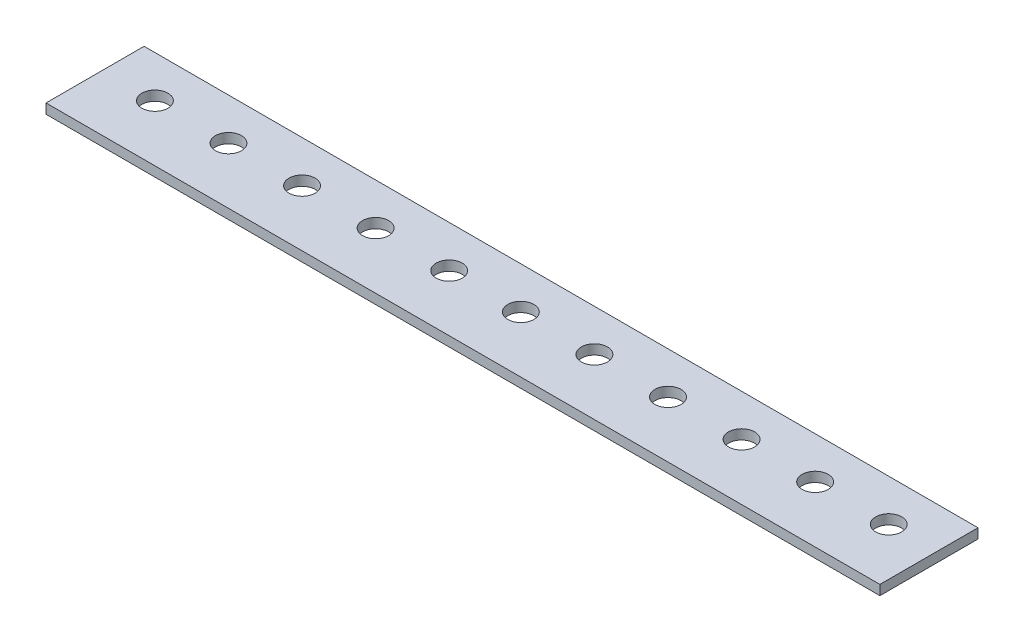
ISO-10303-21;
HEADER;
FILE_DESCRIPTION(('STEP AP214'),'2;1');
FILE_NAME('part.step','',(''),(''),'','','');
FILE_SCHEMA(('AUTOMOTIVE_DESIGN { 1 0 10303 214 1 1 1 1 }'));
ENDSEC;
DATA;
#1=APPLICATION_CONTEXT('core data for automotive mechanical design processes');
#2=APPLICATION_PROTOCOL_DEFINITION('international standard','automotive_design',2000,#1);
#3=PRODUCT_CONTEXT('',#1,'mechanical');
#4=PRODUCT('Part','Part','',(#3));
#5=PRODUCT_RELATED_PRODUCT_CATEGORY('part','',(#4));
#6=PRODUCT_DEFINITION_FORMATION('','',#4);
#7=PRODUCT_DEFINITION_CONTEXT('part definition',#1,'design');
#8=PRODUCT_DEFINITION('design','',#6,#7);
#9=PRODUCT_DEFINITION_SHAPE('','',#8);
#10=(LENGTH_UNIT() NAMED_UNIT(*) SI_UNIT(.MILLI.,.METRE.));
#11=(NAMED_UNIT(*) PLANE_ANGLE_UNIT() SI_UNIT($,.RADIAN.));
#12=(NAMED_UNIT(*) SI_UNIT($,.STERADIAN.) SOLID_ANGLE_UNIT());
#13=UNCERTAINTY_MEASURE_WITH_UNIT(LENGTH_MEASURE(1.E-05),#10,'distance_accuracy_value','');
#14=(GEOMETRIC_REPRESENTATION_CONTEXT(3) GLOBAL_UNCERTAINTY_ASSIGNED_CONTEXT((#13)) GLOBAL_UNIT_ASSIGNED_CONTEXT((#10,
#11,#12)) REPRESENTATION_CONTEXT('',''));
#15=CARTESIAN_POINT('',(0.,0.,0.));
#16=DIRECTION('',(0.,0.,1.));
#17=DIRECTION('',(1.,0.,0.));
#18=AXIS2_PLACEMENT_3D('',#15,#16,#17);
#19=CARTESIAN_POINT('',(0.,2.54,123.825));
#20=DIRECTION('',(0.,0.,1.));
#21=DIRECTION('',(1.,0.,0.));
#22=AXIS2_PLACEMENT_3D('',#19,#20,#21);
#23=PLANE('',#22);
#24=DIRECTION('',(0.,1.,0.));
#25=VECTOR('',#24,1.);
#26=CARTESIAN_POINT('',(-469.842285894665,0.,123.825));
#27=LINE('',#26,#25);
#28=CARTESIAN_POINT('',(-469.842285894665,0.,123.825));
#29=VERTEX_POINT('',#28);
#30=CARTESIAN_POINT('',(-469.842285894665,2.54,123.825));
#31=VERTEX_POINT('',#30);
#32=EDGE_CURVE('E77',#29,#31,#27,.T.);
#33=ORIENTED_EDGE('',*,*,#32,.T.);
#34=DIRECTION('',(-1.,0.,0.));
#35=VECTOR('',#34,1.);
#36=CARTESIAN_POINT('',(0.,2.54,123.825));
#37=LINE('',#36,#35);
#38=CARTESIAN_POINT('',(-253.942285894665,2.54,123.825));
#39=VERTEX_POINT('',#38);
#40=EDGE_CURVE('E43',#39,#31,#37,.T.);
#41=ORIENTED_EDGE('',*,*,#40,.F.);
#42=DIRECTION('',(0.,-1.,0.));
#43=VECTOR('',#42,1.);
#44=CARTESIAN_POINT('',(-253.942285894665,2.54,123.825));
#45=LINE('',#44,#43);
#46=CARTESIAN_POINT('',(-253.942285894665,0.,123.825));
#47=VERTEX_POINT('',#46);
#48=EDGE_CURVE('E11',#39,#47,#45,.T.);
#49=ORIENTED_EDGE('',*,*,#48,.T.);
#50=DIRECTION('',(-1.,0.,0.));
#51=VECTOR('',#50,1.);
#52=CARTESIAN_POINT('',(0.,0.,123.825));
#53=LINE('',#52,#51);
#54=EDGE_CURVE('E93',#47,#29,#53,.T.);
#55=ORIENTED_EDGE('',*,*,#54,.T.);
#56=EDGE_LOOP('',(#33,#41,#49,#55));
#57=FACE_BOUND('',#56,.T.);
#58=ADVANCED_FACE('F35',(#57),#23,.F.);
#59=CARTESIAN_POINT('',(0.,2.54,0.));
#60=DIRECTION('',(0.,1.,0.));
#61=DIRECTION('',(0.,0.,1.));
#62=AXIS2_PLACEMENT_3D('',#59,#60,#61);
#63=PLANE('',#62);
#64=CARTESIAN_POINT('',(-361.511285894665,2.54,134.62));
#65=DIRECTION('',(0.,1.,0.));
#66=DIRECTION('',(0.,0.,1.));
#67=AXIS2_PLACEMENT_3D('',#64,#65,#66);
#68=CIRCLE('',#67,3.37819999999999);
#69=CARTESIAN_POINT('',(-361.511285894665,2.54,137.9982));
#70=VERTEX_POINT('',#69);
#71=EDGE_CURVE('E139',#70,#70,#68,.T.);
#72=ORIENTED_EDGE('',*,*,#71,.F.);
#73=EDGE_LOOP('',(#72));
#74=FACE_BOUND('',#73,.T.);
#75=CARTESIAN_POINT('',(-456.253285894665,2.54,134.62));
#76=DIRECTION('',(0.,1.,0.));
#77=DIRECTION('',(0.,0.,1.));
#78=AXIS2_PLACEMENT_3D('',#75,#76,#77);
#79=CIRCLE('',#78,3.37819999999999);
#80=CARTESIAN_POINT('',(-456.253285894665,2.54,137.9982));
#81=VERTEX_POINT('',#80);
#82=EDGE_CURVE('E142',#81,#81,#79,.T.);
#83=ORIENTED_EDGE('',*,*,#82,.F.);
#84=EDGE_LOOP('',(#83));
#85=FACE_BOUND('',#84,.T.);
#86=CARTESIAN_POINT('',(-437.203285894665,2.54,134.62));
#87=DIRECTION('',(0.,1.,0.));
#88=DIRECTION('',(0.,0.,1.));
#89=AXIS2_PLACEMENT_3D('',#86,#87,#88);
#90=CIRCLE('',#89,3.37819999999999);
#91=CARTESIAN_POINT('',(-437.203285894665,2.54,137.9982));
#92=VERTEX_POINT('',#91);
#93=EDGE_CURVE('E145',#92,#92,#90,.T.);
#94=ORIENTED_EDGE('',*,*,#93,.F.);
#95=EDGE_LOOP('',(#94));
#96=FACE_BOUND('',#95,.T.);
#97=CARTESIAN_POINT('',(-418.153285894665,2.54,134.62));
#98=DIRECTION('',(0.,1.,0.));
#99=DIRECTION('',(0.,0.,1.));
#100=AXIS2_PLACEMENT_3D('',#97,#98,#99);
#101=CIRCLE('',#100,3.37819999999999);
#102=CARTESIAN_POINT('',(-418.153285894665,2.54,137.9982));
#103=VERTEX_POINT('',#102);
#104=EDGE_CURVE('E148',#103,#103,#101,.T.);
#105=ORIENTED_EDGE('',*,*,#104,.F.);
#106=EDGE_LOOP('',(#105));
#107=FACE_BOUND('',#106,.T.);
#108=CARTESIAN_POINT('',(-399.103285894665,2.54,134.62));
#109=DIRECTION('',(0.,1.,0.));
#110=DIRECTION('',(0.,0.,1.));
#111=AXIS2_PLACEMENT_3D('',#108,#109,#110);
#112=CIRCLE('',#111,3.37819999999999);
#113=CARTESIAN_POINT('',(-399.103285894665,2.54,137.9982));
#114=VERTEX_POINT('',#113);
#115=EDGE_CURVE('E151',#114,#114,#112,.T.);
#116=ORIENTED_EDGE('',*,*,#115,.F.);
#117=EDGE_LOOP('',(#116));
#118=FACE_BOUND('',#117,.T.);
#119=CARTESIAN_POINT('',(-380.053285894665,2.54,134.62));
#120=DIRECTION('',(0.,1.,0.));
#121=DIRECTION('',(0.,0.,1.));
#122=AXIS2_PLACEMENT_3D('',#119,#120,#121);
#123=CIRCLE('',#122,3.37819999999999);
#124=CARTESIAN_POINT('',(-380.053285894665,2.54,137.9982));
#125=VERTEX_POINT('',#124);
#126=EDGE_CURVE('E154',#125,#125,#123,.T.);
#127=ORIENTED_EDGE('',*,*,#126,.F.);
#128=EDGE_LOOP('',(#127));
#129=FACE_BOUND('',#128,.T.);
#130=CARTESIAN_POINT('',(-342.461285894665,2.54,134.62));
#131=DIRECTION('',(0.,1.,0.));
#132=DIRECTION('',(0.,0.,1.));
#133=AXIS2_PLACEMENT_3D('',#130,#131,#132);
#134=CIRCLE('',#133,3.37819999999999);
#135=CARTESIAN_POINT('',(-342.461285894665,2.54,137.9982));
#136=VERTEX_POINT('',#135);
#137=EDGE_CURVE('E157',#136,#136,#134,.T.);
#138=ORIENTED_EDGE('',*,*,#137,.F.);
#139=EDGE_LOOP('',(#138));
#140=FACE_BOUND('',#139,.T.);
#141=CARTESIAN_POINT('',(-323.411285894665,2.54,134.62));
#142=DIRECTION('',(0.,1.,0.));
#143=DIRECTION('',(0.,0.,1.));
#144=AXIS2_PLACEMENT_3D('',#141,#142,#143);
#145=CIRCLE('',#144,3.37819999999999);
#146=CARTESIAN_POINT('',(-323.411285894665,2.54,137.9982));
#147=VERTEX_POINT('',#146);
#148=EDGE_CURVE('E160',#147,#147,#145,.T.);
#149=ORIENTED_EDGE('',*,*,#148,.F.);
#150=EDGE_LOOP('',(#149));
#151=FACE_BOUND('',#150,.T.);
#152=CARTESIAN_POINT('',(-304.361285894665,2.54,134.62));
#153=DIRECTION('',(0.,1.,0.));
#154=DIRECTION('',(0.,0.,1.));
#155=AXIS2_PLACEMENT_3D('',#152,#153,#154);
#156=CIRCLE('',#155,3.37819999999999);
#157=CARTESIAN_POINT('',(-304.361285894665,2.54,137.9982));
#158=VERTEX_POINT('',#157);
#159=EDGE_CURVE('E163',#158,#158,#156,.T.);
#160=ORIENTED_EDGE('',*,*,#159,.F.);
#161=EDGE_LOOP('',(#160));
#162=FACE_BOUND('',#161,.T.);
#163=CARTESIAN_POINT('',(-285.311285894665,2.54,134.62));
#164=DIRECTION('',(0.,1.,0.));
#165=DIRECTION('',(0.,0.,1.));
#166=AXIS2_PLACEMENT_3D('',#163,#164,#165);
#167=CIRCLE('',#166,3.37819999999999);
#168=CARTESIAN_POINT('',(-285.311285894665,2.54,137.9982));
#169=VERTEX_POINT('',#168);
#170=EDGE_CURVE('E100',#169,#169,#167,.T.);
#171=ORIENTED_EDGE('',*,*,#170,.F.);
#172=EDGE_LOOP('',(#171));
#173=FACE_BOUND('',#172,.T.);
#174=CARTESIAN_POINT('',(-266.261285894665,2.54,134.62));
#175=DIRECTION('',(0.,1.,0.));
#176=DIRECTION('',(0.,0.,1.));
#177=AXIS2_PLACEMENT_3D('',#174,#175,#176);
#178=CIRCLE('',#177,3.37819999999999);
#179=CARTESIAN_POINT('',(-266.261285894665,2.54,137.9982));
#180=VERTEX_POINT('',#179);
#181=EDGE_CURVE('E97',#180,#180,#178,.T.);
#182=ORIENTED_EDGE('',*,*,#181,.F.);
#183=EDGE_LOOP('',(#182));
#184=FACE_BOUND('',#183,.T.);
#185=ORIENTED_EDGE('',*,*,#40,.T.);
#186=DIRECTION('',(0.,0.,1.));
#187=VECTOR('',#186,1.);
#188=CARTESIAN_POINT('',(-469.842285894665,2.54,0.));
#189=LINE('',#188,#187);
#190=CARTESIAN_POINT('',(-469.842285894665,2.54,149.225));
#191=VERTEX_POINT('',#190);
#192=EDGE_CURVE('E83',#31,#191,#189,.T.);
#193=ORIENTED_EDGE('',*,*,#192,.T.);
#194=DIRECTION('',(-1.,0.,0.));
#195=VECTOR('',#194,1.);
#196=CARTESIAN_POINT('',(0.,2.54,149.225));
#197=LINE('',#196,#195);
#198=CARTESIAN_POINT('',(-253.942285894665,2.54,149.225));
#199=VERTEX_POINT('',#198);
#200=EDGE_CURVE('E94',#199,#191,#197,.T.);
#201=ORIENTED_EDGE('',*,*,#200,.F.);
#202=DIRECTION('',(0.,0.,-1.));
#203=VECTOR('',#202,1.);
#204=CARTESIAN_POINT('',(-253.942285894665,2.54,3.69990252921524E-13));
#205=LINE('',#204,#203);
#206=EDGE_CURVE('E59',#199,#39,#205,.T.);
#207=ORIENTED_EDGE('',*,*,#206,.T.);
#208=EDGE_LOOP('',(#185,#193,#201,#207));
#209=FACE_BOUND('',#208,.T.);
#210=ADVANCED_FACE('F172',(#74,#85,#96,#107,#118,#129,#140,#151,#162,#173,#184,#209),#63,.T.);
#211=CARTESIAN_POINT('',(0.,0.,0.));
#212=DIRECTION('',(0.,1.,0.));
#213=DIRECTION('',(0.,0.,1.));
#214=AXIS2_PLACEMENT_3D('',#211,#212,#213);
#215=PLANE('',#214);
#216=CARTESIAN_POINT('',(-361.511285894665,0.,134.62));
#217=DIRECTION('',(0.,1.,0.));
#218=DIRECTION('',(0.,0.,1.));
#219=AXIS2_PLACEMENT_3D('',#216,#217,#218);
#220=CIRCLE('',#219,3.37819999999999);
#221=CARTESIAN_POINT('',(-361.511285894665,0.,137.9982));
#222=VERTEX_POINT('',#221);
#223=EDGE_CURVE('E102',#222,#222,#220,.T.);
#224=ORIENTED_EDGE('',*,*,#223,.T.);
#225=EDGE_LOOP('',(#224));
#226=FACE_BOUND('',#225,.T.);
#227=CARTESIAN_POINT('',(-456.253285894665,0.,134.62));
#228=DIRECTION('',(0.,1.,0.));
#229=DIRECTION('',(0.,0.,1.));
#230=AXIS2_PLACEMENT_3D('',#227,#228,#229);
#231=CIRCLE('',#230,3.37819999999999);
#232=CARTESIAN_POINT('',(-456.253285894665,0.,137.9982));
#233=VERTEX_POINT('',#232);
#234=EDGE_CURVE('E107',#233,#233,#231,.T.);
#235=ORIENTED_EDGE('',*,*,#234,.T.);
#236=EDGE_LOOP('',(#235));
#237=FACE_BOUND('',#236,.T.);
#238=CARTESIAN_POINT('',(-437.203285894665,0.,134.62));
#239=DIRECTION('',(0.,1.,0.));
#240=DIRECTION('',(0.,0.,1.));
#241=AXIS2_PLACEMENT_3D('',#238,#239,#240);
#242=CIRCLE('',#241,3.37819999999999);
#243=CARTESIAN_POINT('',(-437.203285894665,0.,137.9982));
#244=VERTEX_POINT('',#243);
#245=EDGE_CURVE('E110',#244,#244,#242,.T.);
#246=ORIENTED_EDGE('',*,*,#245,.T.);
#247=EDGE_LOOP('',(#246));
#248=FACE_BOUND('',#247,.T.);
#249=CARTESIAN_POINT('',(-418.153285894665,0.,134.62));
#250=DIRECTION('',(0.,1.,0.));
#251=DIRECTION('',(0.,0.,1.));
#252=AXIS2_PLACEMENT_3D('',#249,#250,#251);
#253=CIRCLE('',#252,3.37819999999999);
#254=CARTESIAN_POINT('',(-418.153285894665,0.,137.9982));
#255=VERTEX_POINT('',#254);
#256=EDGE_CURVE('E113',#255,#255,#253,.T.);
#257=ORIENTED_EDGE('',*,*,#256,.T.);
#258=EDGE_LOOP('',(#257));
#259=FACE_BOUND('',#258,.T.);
#260=CARTESIAN_POINT('',(-399.103285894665,0.,134.62));
#261=DIRECTION('',(0.,1.,0.));
#262=DIRECTION('',(0.,0.,1.));
#263=AXIS2_PLACEMENT_3D('',#260,#261,#262);
#264=CIRCLE('',#263,3.37819999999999);
#265=CARTESIAN_POINT('',(-399.103285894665,0.,137.9982));
#266=VERTEX_POINT('',#265);
#267=EDGE_CURVE('E116',#266,#266,#264,.T.);
#268=ORIENTED_EDGE('',*,*,#267,.T.);
#269=EDGE_LOOP('',(#268));
#270=FACE_BOUND('',#269,.T.);
#271=CARTESIAN_POINT('',(-380.053285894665,0.,134.62));
#272=DIRECTION('',(0.,1.,0.));
#273=DIRECTION('',(0.,0.,1.));
#274=AXIS2_PLACEMENT_3D('',#271,#272,#273);
#275=CIRCLE('',#274,3.37819999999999);
#276=CARTESIAN_POINT('',(-380.053285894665,0.,137.9982));
#277=VERTEX_POINT('',#276);
#278=EDGE_CURVE('E119',#277,#277,#275,.T.);
#279=ORIENTED_EDGE('',*,*,#278,.T.);
#280=EDGE_LOOP('',(#279));
#281=FACE_BOUND('',#280,.T.);
#282=CARTESIAN_POINT('',(-342.461285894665,0.,134.62));
#283=DIRECTION('',(0.,1.,0.));
#284=DIRECTION('',(0.,0.,1.));
#285=AXIS2_PLACEMENT_3D('',#282,#283,#284);
#286=CIRCLE('',#285,3.37819999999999);
#287=CARTESIAN_POINT('',(-342.461285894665,0.,137.9982));
#288=VERTEX_POINT('',#287);
#289=EDGE_CURVE('E122',#288,#288,#286,.T.);
#290=ORIENTED_EDGE('',*,*,#289,.T.);
#291=EDGE_LOOP('',(#290));
#292=FACE_BOUND('',#291,.T.);
#293=CARTESIAN_POINT('',(-323.411285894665,0.,134.62));
#294=DIRECTION('',(0.,1.,0.));
#295=DIRECTION('',(0.,0.,1.));
#296=AXIS2_PLACEMENT_3D('',#293,#294,#295);
#297=CIRCLE('',#296,3.37819999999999);
#298=CARTESIAN_POINT('',(-323.411285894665,0.,137.9982));
#299=VERTEX_POINT('',#298);
#300=EDGE_CURVE('E125',#299,#299,#297,.T.);
#301=ORIENTED_EDGE('',*,*,#300,.T.);
#302=EDGE_LOOP('',(#301));
#303=FACE_BOUND('',#302,.T.);
#304=CARTESIAN_POINT('',(-304.361285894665,0.,134.62));
#305=DIRECTION('',(0.,1.,0.));
#306=DIRECTION('',(0.,0.,1.));
#307=AXIS2_PLACEMENT_3D('',#304,#305,#306);
#308=CIRCLE('',#307,3.37819999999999);
#309=CARTESIAN_POINT('',(-304.361285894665,0.,137.9982));
#310=VERTEX_POINT('',#309);
#311=EDGE_CURVE('E128',#310,#310,#308,.T.);
#312=ORIENTED_EDGE('',*,*,#311,.T.);
#313=EDGE_LOOP('',(#312));
#314=FACE_BOUND('',#313,.T.);
#315=CARTESIAN_POINT('',(-285.311285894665,0.,134.62));
#316=DIRECTION('',(0.,1.,0.));
#317=DIRECTION('',(0.,0.,1.));
#318=AXIS2_PLACEMENT_3D('',#315,#316,#317);
#319=CIRCLE('',#318,3.37819999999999);
#320=CARTESIAN_POINT('',(-285.311285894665,0.,137.9982));
#321=VERTEX_POINT('',#320);
#322=EDGE_CURVE('E131',#321,#321,#319,.T.);
#323=ORIENTED_EDGE('',*,*,#322,.T.);
#324=EDGE_LOOP('',(#323));
#325=FACE_BOUND('',#324,.T.);
#326=CARTESIAN_POINT('',(-266.261285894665,0.,134.62));
#327=DIRECTION('',(0.,1.,0.));
#328=DIRECTION('',(0.,0.,1.));
#329=AXIS2_PLACEMENT_3D('',#326,#327,#328);
#330=CIRCLE('',#329,3.37819999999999);
#331=CARTESIAN_POINT('',(-266.261285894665,0.,137.9982));
#332=VERTEX_POINT('',#331);
#333=EDGE_CURVE('E134',#332,#332,#330,.T.);
#334=ORIENTED_EDGE('',*,*,#333,.T.);
#335=EDGE_LOOP('',(#334));
#336=FACE_BOUND('',#335,.T.);
#337=DIRECTION('',(0.,0.,1.));
#338=VECTOR('',#337,1.);
#339=CARTESIAN_POINT('',(-469.842285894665,0.,0.));
#340=LINE('',#339,#338);
#341=CARTESIAN_POINT('',(-469.842285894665,0.,149.225));
#342=VERTEX_POINT('',#341);
#343=EDGE_CURVE('E80',#29,#342,#340,.T.);
#344=ORIENTED_EDGE('',*,*,#343,.F.);
#345=ORIENTED_EDGE('',*,*,#54,.F.);
#346=DIRECTION('',(0.,0.,-1.));
#347=VECTOR('',#346,1.);
#348=CARTESIAN_POINT('',(-253.942285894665,0.,3.69990252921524E-13));
#349=LINE('',#348,#347);
#350=CARTESIAN_POINT('',(-253.942285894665,0.,149.225));
#351=VERTEX_POINT('',#350);
#352=EDGE_CURVE('E98',#351,#47,#349,.T.);
#353=ORIENTED_EDGE('',*,*,#352,.F.);
#354=DIRECTION('',(-1.,0.,0.));
#355=VECTOR('',#354,1.);
#356=CARTESIAN_POINT('',(0.,0.,149.225));
#357=LINE('',#356,#355);
#358=EDGE_CURVE('E87',#351,#342,#357,.T.);
#359=ORIENTED_EDGE('',*,*,#358,.T.);
#360=EDGE_LOOP('',(#344,#345,#353,#359));
#361=FACE_BOUND('',#360,.T.);
#362=ADVANCED_FACE('F91',(#226,#237,#248,#259,#270,#281,#292,#303,#314,#325,#336,#361),#215,.F.);
#363=CARTESIAN_POINT('',(-253.942285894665,2.54,3.69990252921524E-13));
#364=DIRECTION('',(-1.,0.,0.));
#365=DIRECTION('',(0.,0.,1.));
#366=AXIS2_PLACEMENT_3D('',#363,#364,#365);
#367=PLANE('',#366);
#368=ORIENTED_EDGE('',*,*,#206,.F.);
#369=DIRECTION('',(0.,1.,0.));
#370=VECTOR('',#369,1.);
#371=CARTESIAN_POINT('',(-253.942285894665,0.,149.225));
#372=LINE('',#371,#370);
#373=EDGE_CURVE('E86',#351,#199,#372,.T.);
#374=ORIENTED_EDGE('',*,*,#373,.F.);
#375=ORIENTED_EDGE('',*,*,#352,.T.);
#376=ORIENTED_EDGE('',*,*,#48,.F.);
#377=EDGE_LOOP('',(#368,#374,#375,#376));
#378=FACE_BOUND('',#377,.T.);
#379=ADVANCED_FACE('F174',(#378),#367,.F.);
#380=CARTESIAN_POINT('',(-361.511285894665,2.54,134.62));
#381=DIRECTION('',(0.,-1.,0.));
#382=DIRECTION('',(0.,0.,-1.));
#383=AXIS2_PLACEMENT_3D('',#380,#381,#382);
#384=CYLINDRICAL_SURFACE('',#383,3.37819999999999);
#385=ORIENTED_EDGE('',*,*,#71,.T.);
#386=EDGE_LOOP('',(#385));
#387=FACE_BOUND('',#386,.T.);
#388=ORIENTED_EDGE('',*,*,#223,.F.);
#389=EDGE_LOOP('',(#388));
#390=FACE_BOUND('',#389,.T.);
#391=ADVANCED_FACE('F194',(#387,#390),#384,.F.);
#392=CARTESIAN_POINT('',(-456.253285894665,2.54,134.62));
#393=DIRECTION('',(0.,-1.,0.));
#394=DIRECTION('',(0.,0.,-1.));
#395=AXIS2_PLACEMENT_3D('',#392,#393,#394);
#396=CYLINDRICAL_SURFACE('',#395,3.37819999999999);
#397=ORIENTED_EDGE('',*,*,#82,.T.);
#398=EDGE_LOOP('',(#397));
#399=FACE_BOUND('',#398,.T.);
#400=ORIENTED_EDGE('',*,*,#234,.F.);
#401=EDGE_LOOP('',(#400));
#402=FACE_BOUND('',#401,.T.);
#403=ADVANCED_FACE('F197',(#399,#402),#396,.F.);
#404=CARTESIAN_POINT('',(-437.203285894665,2.54,134.62));
#405=DIRECTION('',(0.,-1.,0.));
#406=DIRECTION('',(0.,0.,-1.));
#407=AXIS2_PLACEMENT_3D('',#404,#405,#406);
#408=CYLINDRICAL_SURFACE('',#407,3.37819999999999);
#409=ORIENTED_EDGE('',*,*,#93,.T.);
#410=EDGE_LOOP('',(#409));
#411=FACE_BOUND('',#410,.T.);
#412=ORIENTED_EDGE('',*,*,#245,.F.);
#413=EDGE_LOOP('',(#412));
#414=FACE_BOUND('',#413,.T.);
#415=ADVANCED_FACE('F201',(#411,#414),#408,.F.);
#416=CARTESIAN_POINT('',(-418.153285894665,2.54,134.62));
#417=DIRECTION('',(0.,-1.,0.));
#418=DIRECTION('',(0.,0.,-1.));
#419=AXIS2_PLACEMENT_3D('',#416,#417,#418);
#420=CYLINDRICAL_SURFACE('',#419,3.37819999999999);
#421=ORIENTED_EDGE('',*,*,#104,.T.);
#422=EDGE_LOOP('',(#421));
#423=FACE_BOUND('',#422,.T.);
#424=ORIENTED_EDGE('',*,*,#256,.F.);
#425=EDGE_LOOP('',(#424));
#426=FACE_BOUND('',#425,.T.);
#427=ADVANCED_FACE('F205',(#423,#426),#420,.F.);
#428=CARTESIAN_POINT('',(-399.103285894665,2.54,134.62));
#429=DIRECTION('',(0.,-1.,0.));
#430=DIRECTION('',(0.,0.,-1.));
#431=AXIS2_PLACEMENT_3D('',#428,#429,#430);
#432=CYLINDRICAL_SURFACE('',#431,3.37819999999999);
#433=ORIENTED_EDGE('',*,*,#115,.T.);
#434=EDGE_LOOP('',(#433));
#435=FACE_BOUND('',#434,.T.);
#436=ORIENTED_EDGE('',*,*,#267,.F.);
#437=EDGE_LOOP('',(#436));
#438=FACE_BOUND('',#437,.T.);
#439=ADVANCED_FACE('F209',(#435,#438),#432,.F.);
#440=CARTESIAN_POINT('',(-380.053285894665,2.54,134.62));
#441=DIRECTION('',(0.,-1.,0.));
#442=DIRECTION('',(0.,0.,-1.));
#443=AXIS2_PLACEMENT_3D('',#440,#441,#442);
#444=CYLINDRICAL_SURFACE('',#443,3.37819999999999);
#445=ORIENTED_EDGE('',*,*,#126,.T.);
#446=EDGE_LOOP('',(#445));
#447=FACE_BOUND('',#446,.T.);
#448=ORIENTED_EDGE('',*,*,#278,.F.);
#449=EDGE_LOOP('',(#448));
#450=FACE_BOUND('',#449,.T.);
#451=ADVANCED_FACE('F213',(#447,#450),#444,.F.);
#452=CARTESIAN_POINT('',(-342.461285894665,2.54,134.62));
#453=DIRECTION('',(0.,-1.,0.));
#454=DIRECTION('',(0.,0.,-1.));
#455=AXIS2_PLACEMENT_3D('',#452,#453,#454);
#456=CYLINDRICAL_SURFACE('',#455,3.37819999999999);
#457=ORIENTED_EDGE('',*,*,#137,.T.);
#458=EDGE_LOOP('',(#457));
#459=FACE_BOUND('',#458,.T.);
#460=ORIENTED_EDGE('',*,*,#289,.F.);
#461=EDGE_LOOP('',(#460));
#462=FACE_BOUND('',#461,.T.);
#463=ADVANCED_FACE('F217',(#459,#462),#456,.F.);
#464=CARTESIAN_POINT('',(-323.411285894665,2.54,134.62));
#465=DIRECTION('',(0.,-1.,0.));
#466=DIRECTION('',(0.,0.,-1.));
#467=AXIS2_PLACEMENT_3D('',#464,#465,#466);
#468=CYLINDRICAL_SURFACE('',#467,3.37819999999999);
#469=ORIENTED_EDGE('',*,*,#148,.T.);
#470=EDGE_LOOP('',(#469));
#471=FACE_BOUND('',#470,.T.);
#472=ORIENTED_EDGE('',*,*,#300,.F.);
#473=EDGE_LOOP('',(#472));
#474=FACE_BOUND('',#473,.T.);
#475=ADVANCED_FACE('F221',(#471,#474),#468,.F.);
#476=CARTESIAN_POINT('',(-304.361285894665,2.54,134.62));
#477=DIRECTION('',(0.,-1.,0.));
#478=DIRECTION('',(0.,0.,-1.));
#479=AXIS2_PLACEMENT_3D('',#476,#477,#478);
#480=CYLINDRICAL_SURFACE('',#479,3.37819999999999);
#481=ORIENTED_EDGE('',*,*,#159,.T.);
#482=EDGE_LOOP('',(#481));
#483=FACE_BOUND('',#482,.T.);
#484=ORIENTED_EDGE('',*,*,#311,.F.);
#485=EDGE_LOOP('',(#484));
#486=FACE_BOUND('',#485,.T.);
#487=ADVANCED_FACE('F225',(#483,#486),#480,.F.);
#488=CARTESIAN_POINT('',(-285.311285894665,2.54,134.62));
#489=DIRECTION('',(0.,-1.,0.));
#490=DIRECTION('',(0.,0.,-1.));
#491=AXIS2_PLACEMENT_3D('',#488,#489,#490);
#492=CYLINDRICAL_SURFACE('',#491,3.37819999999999);
#493=ORIENTED_EDGE('',*,*,#170,.T.);
#494=EDGE_LOOP('',(#493));
#495=FACE_BOUND('',#494,.T.);
#496=ORIENTED_EDGE('',*,*,#322,.F.);
#497=EDGE_LOOP('',(#496));
#498=FACE_BOUND('',#497,.T.);
#499=ADVANCED_FACE('F228',(#495,#498),#492,.F.);
#500=CARTESIAN_POINT('',(-266.261285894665,2.54,134.62));
#501=DIRECTION('',(0.,-1.,0.));
#502=DIRECTION('',(0.,0.,-1.));
#503=AXIS2_PLACEMENT_3D('',#500,#501,#502);
#504=CYLINDRICAL_SURFACE('',#503,3.37819999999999);
#505=ORIENTED_EDGE('',*,*,#181,.T.);
#506=EDGE_LOOP('',(#505));
#507=FACE_BOUND('',#506,.T.);
#508=ORIENTED_EDGE('',*,*,#333,.F.);
#509=EDGE_LOOP('',(#508));
#510=FACE_BOUND('',#509,.T.);
#511=ADVANCED_FACE('F37',(#507,#510),#504,.F.);
#512=CARTESIAN_POINT('',(-469.842285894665,0.,0.));
#513=DIRECTION('',(-1.,0.,0.));
#514=DIRECTION('',(0.,0.,1.));
#515=AXIS2_PLACEMENT_3D('',#512,#513,#514);
#516=PLANE('',#515);
#517=ORIENTED_EDGE('',*,*,#192,.F.);
#518=ORIENTED_EDGE('',*,*,#32,.F.);
#519=ORIENTED_EDGE('',*,*,#343,.T.);
#520=DIRECTION('',(0.,1.,0.));
#521=VECTOR('',#520,1.);
#522=CARTESIAN_POINT('',(-469.842285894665,0.,149.225));
#523=LINE('',#522,#521);
#524=EDGE_CURVE('E50',#342,#191,#523,.T.);
#525=ORIENTED_EDGE('',*,*,#524,.T.);
#526=EDGE_LOOP('',(#517,#518,#519,#525));
#527=FACE_BOUND('',#526,.T.);
#528=ADVANCED_FACE('F79',(#527),#516,.T.);
#529=CARTESIAN_POINT('',(0.,0.,149.225));
#530=DIRECTION('',(0.,0.,-1.));
#531=DIRECTION('',(-1.,0.,0.));
#532=AXIS2_PLACEMENT_3D('',#529,#530,#531);
#533=PLANE('',#532);
#534=ORIENTED_EDGE('',*,*,#200,.T.);
#535=ORIENTED_EDGE('',*,*,#524,.F.);
#536=ORIENTED_EDGE('',*,*,#358,.F.);
#537=ORIENTED_EDGE('',*,*,#373,.T.);
#538=EDGE_LOOP('',(#534,#535,#536,#537));
#539=FACE_BOUND('',#538,.T.);
#540=ADVANCED_FACE('F176',(#539),#533,.F.);
#541=CLOSED_SHELL('',(#58,#210,#362,#379,#391,#403,#415,#427,#439,#451,#463,#475,#487,#499,#511,
#528,#540));
#542=MANIFOLD_SOLID_BREP('B2',#541);
#543=ADVANCED_BREP_SHAPE_REPRESENTATION('',(#18,#542),#14);
#544=SHAPE_DEFINITION_REPRESENTATION(#9,#543);
ENDSEC;
END-ISO-10303-21;
